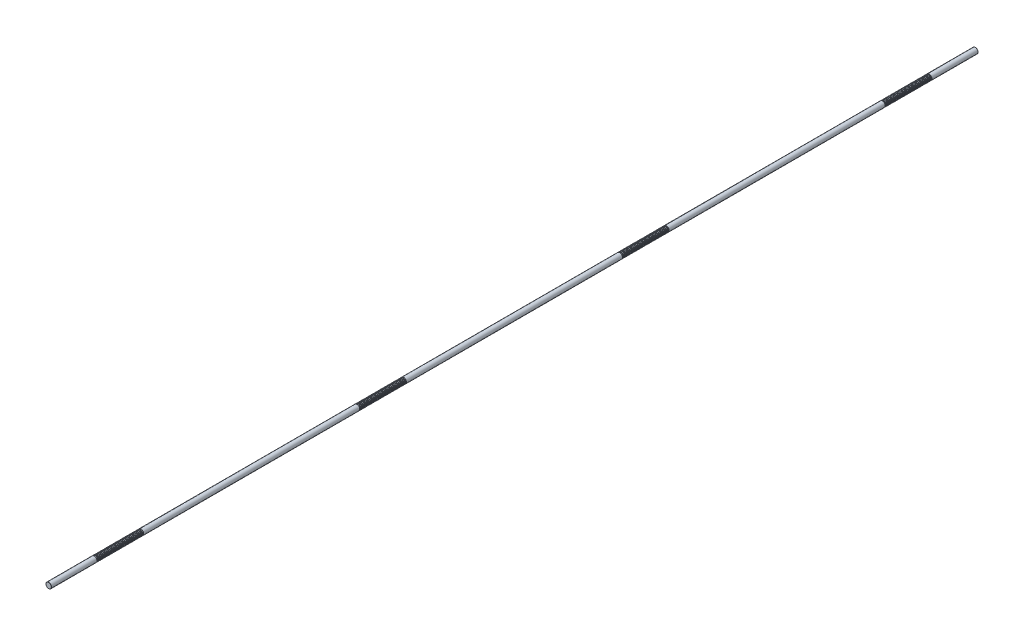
from build123d import *

# Parameters (mm, degrees)
SKETCH1_R           = 6
BOSS_EXTRUDE1_DEPTH = 1000
CHAMFER1_SIZE       = 0.3
LPATTERN1_COUNT     = 34
LPATTERN1_PITCH     = 3
LPATTERN2_COUNT     = 4
LPATTERN2_PITCH     = 567


with BuildPart() as part:
    # Sketch1 → Boss-Extrude1 (new, symmetric)
    with BuildSketch(Plane.XY):
        Circle(SKETCH1_R)
    extrude(amount=BOSS_EXTRUDE1_DEPTH, both=True)

    # Chamfer1
    chamfer1_edges = [part.edges().sort_by_distance(p)[0] for p in [
        (-6, 0, -1000),
        (-6, 0, 1000),
    ]]
    chamfer(chamfer1_edges, length=CHAMFER1_SIZE)

    # Sketch2 → Cut-Revolve1 (revolve, cut)
    with BuildSketch(Plane(origin=(0, 0, 0), x_dir=(0, 0, -1), z_dir=(1, 0, 0)), mode=Mode.PRIVATE) as cut_revolve1_sk:
        Polygon((900.234455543, 6), (898.265544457, 6), (898.734455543, 4.25), (899.765544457, 4.25), align=None)
    cut_revolve1 = revolve(cut_revolve1_sk.sketch.rotate(Axis((0, 0, 1000), (0, 0, -1)), 90), axis=Axis((0, 0, 1000), (0, 0, -1)), mode=Mode.SUBTRACT)

    # LPattern1: Cut-Revolve1 ×34
    with Locations(*[(0, 0, i * LPATTERN1_PITCH) for i in range(1, LPATTERN1_COUNT)]):
        add(cut_revolve1, mode=Mode.SUBTRACT)

    # LPattern2: Cut-Revolve1 ×4
    with Locations(*[(0, 0, i * LPATTERN2_PITCH) for i in range(1, LPATTERN2_COUNT)]):
        add(cut_revolve1, mode=Mode.SUBTRACT)

    # LPattern2 copy 1 sketch → LPattern2 copy 1 (revolve, cut)
    with BuildSketch(Plane(origin=(0, 0, 570), x_dir=(0, 0, -1), z_dir=(1, 0, 0))):
        Polygon((900.234455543, 6), (898.265544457, 6), (898.734455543, 4.25), (899.765544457, 4.25), align=None)
    revolve(axis=Axis((0, 0, 1570), (0, 0, -1)), mode=Mode.SUBTRACT)

    # LPattern2 copy 2 sketch → LPattern2 copy 2 (revolve, cut)
    with BuildSketch(Plane(origin=(0, 0, 1137), x_dir=(0, 0, -1), z_dir=(1, 0, 0))):
        Polygon((900.234455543, 6), (898.265544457, 6), (898.734455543, 4.25), (899.765544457, 4.25), align=None)
    revolve(axis=Axis((0, 0, 2137), (0, 0, -1)), mode=Mode.SUBTRACT)

    # LPattern2 copy 3 sketch → LPattern2 copy 3 (revolve, cut)
    with BuildSketch(Plane(origin=(0, 0, 1704), x_dir=(0, 0, -1), z_dir=(1, 0, 0))):
        Polygon((900.234455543, 6), (898.265544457, 6), (898.734455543, 4.25), (899.765544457, 4.25), align=None)
    revolve(axis=Axis((0, 0, 2704), (0, 0, -1)), mode=Mode.SUBTRACT)

    # LPattern2 copy 4 sketch → LPattern2 copy 4 (revolve, cut)
    with BuildSketch(Plane(origin=(0, 0, 573), x_dir=(0, 0, -1), z_dir=(1, 0, 0))):
        Polygon((900.234455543, 6), (898.265544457, 6), (898.734455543, 4.25), (899.765544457, 4.25), align=None)
    revolve(axis=Axis((0, 0, 1573), (0, 0, -1)), mode=Mode.SUBTRACT)

    # LPattern2 copy 5 sketch → LPattern2 copy 5 (revolve, cut)
    with BuildSketch(Plane(origin=(0, 0, 1140), x_dir=(0, 0, -1), z_dir=(1, 0, 0))):
        Polygon((900.234455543, 6), (898.265544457, 6), (898.734455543, 4.25), (899.765544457, 4.25), align=None)
    revolve(axis=Axis((0, 0, 2140), (0, 0, -1)), mode=Mode.SUBTRACT)

    # LPattern2 copy 6 sketch → LPattern2 copy 6 (revolve, cut)
    with BuildSketch(Plane(origin=(0, 0, 1707), x_dir=(0, 0, -1), z_dir=(1, 0, 0))):
        Polygon((900.234455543, 6), (898.265544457, 6), (898.734455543, 4.25), (899.765544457, 4.25), align=None)
    revolve(axis=Axis((0, 0, 2707), (0, 0, -1)), mode=Mode.SUBTRACT)

    # LPattern2 copy 7 sketch → LPattern2 copy 7 (revolve, cut)
    with BuildSketch(Plane(origin=(0, 0, 576), x_dir=(0, 0, -1), z_dir=(1, 0, 0))):
        Polygon((900.234455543, 6), (898.265544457, 6), (898.734455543, 4.25), (899.765544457, 4.25), align=None)
    revolve(axis=Axis((0, 0, 1576), (0, 0, -1)), mode=Mode.SUBTRACT)

    # LPattern2 copy 8 sketch → LPattern2 copy 8 (revolve, cut)
    with BuildSketch(Plane(origin=(0, 0, 1143), x_dir=(0, 0, -1), z_dir=(1, 0, 0))):
        Polygon((900.234455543, 6), (898.265544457, 6), (898.734455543, 4.25), (899.765544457, 4.25), align=None)
    revolve(axis=Axis((0, 0, 2143), (0, 0, -1)), mode=Mode.SUBTRACT)

    # LPattern2 copy 9 sketch → LPattern2 copy 9 (revolve, cut)
    with BuildSketch(Plane(origin=(0, 0, 1710), x_dir=(0, 0, -1), z_dir=(1, 0, 0))):
        Polygon((900.234455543, 6), (898.265544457, 6), (898.734455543, 4.25), (899.765544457, 4.25), align=None)
    revolve(axis=Axis((0, 0, 2710), (0, 0, -1)), mode=Mode.SUBTRACT)

    # LPattern2 copy 10 sketch → LPattern2 copy 10 (revolve, cut)
    with BuildSketch(Plane(origin=(0, 0, 579), x_dir=(0, 0, -1), z_dir=(1, 0, 0))):
        Polygon((900.234455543, 6), (898.265544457, 6), (898.734455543, 4.25), (899.765544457, 4.25), align=None)
    revolve(axis=Axis((0, 0, 1579), (0, 0, -1)), mode=Mode.SUBTRACT)

    # LPattern2 copy 11 sketch → LPattern2 copy 11 (revolve, cut)
    with BuildSketch(Plane(origin=(0, 0, 1146), x_dir=(0, 0, -1), z_dir=(1, 0, 0))):
        Polygon((900.234455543, 6), (898.265544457, 6), (898.734455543, 4.25), (899.765544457, 4.25), align=None)
    revolve(axis=Axis((0, 0, 2146), (0, 0, -1)), mode=Mode.SUBTRACT)

    # LPattern2 copy 12 sketch → LPattern2 copy 12 (revolve, cut)
    with BuildSketch(Plane(origin=(0, 0, 1713), x_dir=(0, 0, -1), z_dir=(1, 0, 0))):
        Polygon((900.234455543, 6), (898.265544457, 6), (898.734455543, 4.25), (899.765544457, 4.25), align=None)
    revolve(axis=Axis((0, 0, 2713), (0, 0, -1)), mode=Mode.SUBTRACT)

    # LPattern2 copy 13 sketch → LPattern2 copy 13 (revolve, cut)
    with BuildSketch(Plane(origin=(0, 0, 582), x_dir=(0, 0, -1), z_dir=(1, 0, 0))):
        Polygon((900.234455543, 6), (898.265544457, 6), (898.734455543, 4.25), (899.765544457, 4.25), align=None)
    revolve(axis=Axis((0, 0, 1582), (0, 0, -1)), mode=Mode.SUBTRACT)

    # LPattern2 copy 14 sketch → LPattern2 copy 14 (revolve, cut)
    with BuildSketch(Plane(origin=(0, 0, 1149), x_dir=(0, 0, -1), z_dir=(1, 0, 0))):
        Polygon((900.234455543, 6), (898.265544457, 6), (898.734455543, 4.25), (899.765544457, 4.25), align=None)
    revolve(axis=Axis((0, 0, 2149), (0, 0, -1)), mode=Mode.SUBTRACT)

    # LPattern2 copy 15 sketch → LPattern2 copy 15 (revolve, cut)
    with BuildSketch(Plane(origin=(0, 0, 1716), x_dir=(0, 0, -1), z_dir=(1, 0, 0))):
        Polygon((900.234455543, 6), (898.265544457, 6), (898.734455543, 4.25), (899.765544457, 4.25), align=None)
    revolve(axis=Axis((0, 0, 2716), (0, 0, -1)), mode=Mode.SUBTRACT)

    # LPattern2 copy 16 sketch → LPattern2 copy 16 (revolve, cut)
    with BuildSketch(Plane(origin=(0, 0, 585), x_dir=(0, 0, -1), z_dir=(1, 0, 0))):
        Polygon((900.234455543, 6), (898.265544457, 6), (898.734455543, 4.25), (899.765544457, 4.25), align=None)
    revolve(axis=Axis((0, 0, 1585), (0, 0, -1)), mode=Mode.SUBTRACT)

    # LPattern2 copy 17 sketch → LPattern2 copy 17 (revolve, cut)
    with BuildSketch(Plane(origin=(0, 0, 1152), x_dir=(0, 0, -1), z_dir=(1, 0, 0))):
        Polygon((900.234455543, 6), (898.265544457, 6), (898.734455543, 4.25), (899.765544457, 4.25), align=None)
    revolve(axis=Axis((0, 0, 2152), (0, 0, -1)), mode=Mode.SUBTRACT)

    # LPattern2 copy 18 sketch → LPattern2 copy 18 (revolve, cut)
    with BuildSketch(Plane(origin=(0, 0, 1719), x_dir=(0, 0, -1), z_dir=(1, 0, 0))):
        Polygon((900.234455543, 6), (898.265544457, 6), (898.734455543, 4.25), (899.765544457, 4.25), align=None)
    revolve(axis=Axis((0, 0, 2719), (0, 0, -1)), mode=Mode.SUBTRACT)

    # LPattern2 copy 19 sketch → LPattern2 copy 19 (revolve, cut)
    with BuildSketch(Plane(origin=(0, 0, 588), x_dir=(0, 0, -1), z_dir=(1, 0, 0))):
        Polygon((900.234455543, 6), (898.265544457, 6), (898.734455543, 4.25), (899.765544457, 4.25), align=None)
    revolve(axis=Axis((0, 0, 1588), (0, 0, -1)), mode=Mode.SUBTRACT)

    # LPattern2 copy 20 sketch → LPattern2 copy 20 (revolve, cut)
    with BuildSketch(Plane(origin=(0, 0, 1155), x_dir=(0, 0, -1), z_dir=(1, 0, 0))):
        Polygon((900.234455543, 6), (898.265544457, 6), (898.734455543, 4.25), (899.765544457, 4.25), align=None)
    revolve(axis=Axis((0, 0, 2155), (0, 0, -1)), mode=Mode.SUBTRACT)

    # LPattern2 copy 21 sketch → LPattern2 copy 21 (revolve, cut)
    with BuildSketch(Plane(origin=(0, 0, 1722), x_dir=(0, 0, -1), z_dir=(1, 0, 0))):
        Polygon((900.234455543, 6), (898.265544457, 6), (898.734455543, 4.25), (899.765544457, 4.25), align=None)
    revolve(axis=Axis((0, 0, 2722), (0, 0, -1)), mode=Mode.SUBTRACT)

    # LPattern2 copy 22 sketch → LPattern2 copy 22 (revolve, cut)
    with BuildSketch(Plane(origin=(0, 0, 591), x_dir=(0, 0, -1), z_dir=(1, 0, 0))):
        Polygon((900.234455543, 6), (898.265544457, 6), (898.734455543, 4.25), (899.765544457, 4.25), align=None)
    revolve(axis=Axis((0, 0, 1591), (0, 0, -1)), mode=Mode.SUBTRACT)

    # LPattern2 copy 23 sketch → LPattern2 copy 23 (revolve, cut)
    with BuildSketch(Plane(origin=(0, 0, 1158), x_dir=(0, 0, -1), z_dir=(1, 0, 0))):
        Polygon((900.234455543, 6), (898.265544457, 6), (898.734455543, 4.25), (899.765544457, 4.25), align=None)
    revolve(axis=Axis((0, 0, 2158), (0, 0, -1)), mode=Mode.SUBTRACT)

    # LPattern2 copy 24 sketch → LPattern2 copy 24 (revolve, cut)
    with BuildSketch(Plane(origin=(0, 0, 1725), x_dir=(0, 0, -1), z_dir=(1, 0, 0))):
        Polygon((900.234455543, 6), (898.265544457, 6), (898.734455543, 4.25), (899.765544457, 4.25), align=None)
    revolve(axis=Axis((0, 0, 2725), (0, 0, -1)), mode=Mode.SUBTRACT)

    # LPattern2 copy 25 sketch → LPattern2 copy 25 (revolve, cut)
    with BuildSketch(Plane(origin=(0, 0, 594), x_dir=(0, 0, -1), z_dir=(1, 0, 0))):
        Polygon((900.234455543, 6), (898.265544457, 6), (898.734455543, 4.25), (899.765544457, 4.25), align=None)
    revolve(axis=Axis((0, 0, 1594), (0, 0, -1)), mode=Mode.SUBTRACT)

    # LPattern2 copy 26 sketch → LPattern2 copy 26 (revolve, cut)
    with BuildSketch(Plane(origin=(0, 0, 1161), x_dir=(0, 0, -1), z_dir=(1, 0, 0))):
        Polygon((900.234455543, 6), (898.265544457, 6), (898.734455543, 4.25), (899.765544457, 4.25), align=None)
    revolve(axis=Axis((0, 0, 2161), (0, 0, -1)), mode=Mode.SUBTRACT)

    # LPattern2 copy 27 sketch → LPattern2 copy 27 (revolve, cut)
    with BuildSketch(Plane(origin=(0, 0, 1728), x_dir=(0, 0, -1), z_dir=(1, 0, 0))):
        Polygon((900.234455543, 6), (898.265544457, 6), (898.734455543, 4.25), (899.765544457, 4.25), align=None)
    revolve(axis=Axis((0, 0, 2728), (0, 0, -1)), mode=Mode.SUBTRACT)

    # LPattern2 copy 28 sketch → LPattern2 copy 28 (revolve, cut)
    with BuildSketch(Plane(origin=(0, 0, 597), x_dir=(0, 0, -1), z_dir=(1, 0, 0))):
        Polygon((900.234455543, 6), (898.265544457, 6), (898.734455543, 4.25), (899.765544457, 4.25), align=None)
    revolve(axis=Axis((0, 0, 1597), (0, 0, -1)), mode=Mode.SUBTRACT)

    # LPattern2 copy 29 sketch → LPattern2 copy 29 (revolve, cut)
    with BuildSketch(Plane(origin=(0, 0, 1164), x_dir=(0, 0, -1), z_dir=(1, 0, 0))):
        Polygon((900.234455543, 6), (898.265544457, 6), (898.734455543, 4.25), (899.765544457, 4.25), align=None)
    revolve(axis=Axis((0, 0, 2164), (0, 0, -1)), mode=Mode.SUBTRACT)

    # LPattern2 copy 30 sketch → LPattern2 copy 30 (revolve, cut)
    with BuildSketch(Plane(origin=(0, 0, 1731), x_dir=(0, 0, -1), z_dir=(1, 0, 0))):
        Polygon((900.234455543, 6), (898.265544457, 6), (898.734455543, 4.25), (899.765544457, 4.25), align=None)
    revolve(axis=Axis((0, 0, 2731), (0, 0, -1)), mode=Mode.SUBTRACT)

    # LPattern2 copy 31 sketch → LPattern2 copy 31 (revolve, cut)
    with BuildSketch(Plane(origin=(0, 0, 600), x_dir=(0, 0, -1), z_dir=(1, 0, 0))):
        Polygon((900.234455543, 6), (898.265544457, 6), (898.734455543, 4.25), (899.765544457, 4.25), align=None)
    revolve(axis=Axis((0, 0, 1600), (0, 0, -1)), mode=Mode.SUBTRACT)

    # LPattern2 copy 32 sketch → LPattern2 copy 32 (revolve, cut)
    with BuildSketch(Plane(origin=(0, 0, 1167), x_dir=(0, 0, -1), z_dir=(1, 0, 0))):
        Polygon((900.234455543, 6), (898.265544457, 6), (898.734455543, 4.25), (899.765544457, 4.25), align=None)
    revolve(axis=Axis((0, 0, 2167), (0, 0, -1)), mode=Mode.SUBTRACT)

    # LPattern2 copy 33 sketch → LPattern2 copy 33 (revolve, cut)
    with BuildSketch(Plane(origin=(0, 0, 1734), x_dir=(0, 0, -1), z_dir=(1, 0, 0))):
        Polygon((900.234455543, 6), (898.265544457, 6), (898.734455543, 4.25), (899.765544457, 4.25), align=None)
    revolve(axis=Axis((0, 0, 2734), (0, 0, -1)), mode=Mode.SUBTRACT)

    # LPattern2 copy 34 sketch → LPattern2 copy 34 (revolve, cut)
    with BuildSketch(Plane(origin=(0, 0, 603), x_dir=(0, 0, -1), z_dir=(1, 0, 0))):
        Polygon((900.234455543, 6), (898.265544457, 6), (898.734455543, 4.25), (899.765544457, 4.25), align=None)
    revolve(axis=Axis((0, 0, 1603), (0, 0, -1)), mode=Mode.SUBTRACT)

    # LPattern2 copy 35 sketch → LPattern2 copy 35 (revolve, cut)
    with BuildSketch(Plane(origin=(0, 0, 1170), x_dir=(0, 0, -1), z_dir=(1, 0, 0))):
        Polygon((900.234455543, 6), (898.265544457, 6), (898.734455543, 4.25), (899.765544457, 4.25), align=None)
    revolve(axis=Axis((0, 0, 2170), (0, 0, -1)), mode=Mode.SUBTRACT)

    # LPattern2 copy 36 sketch → LPattern2 copy 36 (revolve, cut)
    with BuildSketch(Plane(origin=(0, 0, 1737), x_dir=(0, 0, -1), z_dir=(1, 0, 0))):
        Polygon((900.234455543, 6), (898.265544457, 6), (898.734455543, 4.25), (899.765544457, 4.25), align=None)
    revolve(axis=Axis((0, 0, 2737), (0, 0, -1)), mode=Mode.SUBTRACT)

    # LPattern2 copy 37 sketch → LPattern2 copy 37 (revolve, cut)
    with BuildSketch(Plane(origin=(0, 0, 606), x_dir=(0, 0, -1), z_dir=(1, 0, 0))):
        Polygon((900.234455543, 6), (898.265544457, 6), (898.734455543, 4.25), (899.765544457, 4.25), align=None)
    revolve(axis=Axis((0, 0, 1606), (0, 0, -1)), mode=Mode.SUBTRACT)

    # LPattern2 copy 38 sketch → LPattern2 copy 38 (revolve, cut)
    with BuildSketch(Plane(origin=(0, 0, 1173), x_dir=(0, 0, -1), z_dir=(1, 0, 0))):
        Polygon((900.234455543, 6), (898.265544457, 6), (898.734455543, 4.25), (899.765544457, 4.25), align=None)
    revolve(axis=Axis((0, 0, 2173), (0, 0, -1)), mode=Mode.SUBTRACT)

    # LPattern2 copy 39 sketch → LPattern2 copy 39 (revolve, cut)
    with BuildSketch(Plane(origin=(0, 0, 1740), x_dir=(0, 0, -1), z_dir=(1, 0, 0))):
        Polygon((900.234455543, 6), (898.265544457, 6), (898.734455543, 4.25), (899.765544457, 4.25), align=None)
    revolve(axis=Axis((0, 0, 2740), (0, 0, -1)), mode=Mode.SUBTRACT)

    # LPattern2 copy 40 sketch → LPattern2 copy 40 (revolve, cut)
    with BuildSketch(Plane(origin=(0, 0, 609), x_dir=(0, 0, -1), z_dir=(1, 0, 0))):
        Polygon((900.234455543, 6), (898.265544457, 6), (898.734455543, 4.25), (899.765544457, 4.25), align=None)
    revolve(axis=Axis((0, 0, 1609), (0, 0, -1)), mode=Mode.SUBTRACT)

    # LPattern2 copy 41 sketch → LPattern2 copy 41 (revolve, cut)
    with BuildSketch(Plane(origin=(0, 0, 1176), x_dir=(0, 0, -1), z_dir=(1, 0, 0))):
        Polygon((900.234455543, 6), (898.265544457, 6), (898.734455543, 4.25), (899.765544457, 4.25), align=None)
    revolve(axis=Axis((0, 0, 2176), (0, 0, -1)), mode=Mode.SUBTRACT)

    # LPattern2 copy 42 sketch → LPattern2 copy 42 (revolve, cut)
    with BuildSketch(Plane(origin=(0, 0, 1743), x_dir=(0, 0, -1), z_dir=(1, 0, 0))):
        Polygon((900.234455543, 6), (898.265544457, 6), (898.734455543, 4.25), (899.765544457, 4.25), align=None)
    revolve(axis=Axis((0, 0, 2743), (0, 0, -1)), mode=Mode.SUBTRACT)

    # LPattern2 copy 43 sketch → LPattern2 copy 43 (revolve, cut)
    with BuildSketch(Plane(origin=(0, 0, 612), x_dir=(0, 0, -1), z_dir=(1, 0, 0))):
        Polygon((900.234455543, 6), (898.265544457, 6), (898.734455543, 4.25), (899.765544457, 4.25), align=None)
    revolve(axis=Axis((0, 0, 1612), (0, 0, -1)), mode=Mode.SUBTRACT)

    # LPattern2 copy 44 sketch → LPattern2 copy 44 (revolve, cut)
    with BuildSketch(Plane(origin=(0, 0, 1179), x_dir=(0, 0, -1), z_dir=(1, 0, 0))):
        Polygon((900.234455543, 6), (898.265544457, 6), (898.734455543, 4.25), (899.765544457, 4.25), align=None)
    revolve(axis=Axis((0, 0, 2179), (0, 0, -1)), mode=Mode.SUBTRACT)

    # LPattern2 copy 45 sketch → LPattern2 copy 45 (revolve, cut)
    with BuildSketch(Plane(origin=(0, 0, 1746), x_dir=(0, 0, -1), z_dir=(1, 0, 0))):
        Polygon((900.234455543, 6), (898.265544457, 6), (898.734455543, 4.25), (899.765544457, 4.25), align=None)
    revolve(axis=Axis((0, 0, 2746), (0, 0, -1)), mode=Mode.SUBTRACT)

    # LPattern2 copy 46 sketch → LPattern2 copy 46 (revolve, cut)
    with BuildSketch(Plane(origin=(0, 0, 615), x_dir=(0, 0, -1), z_dir=(1, 0, 0))):
        Polygon((900.234455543, 6), (898.265544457, 6), (898.734455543, 4.25), (899.765544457, 4.25), align=None)
    revolve(axis=Axis((0, 0, 1615), (0, 0, -1)), mode=Mode.SUBTRACT)

    # LPattern2 copy 47 sketch → LPattern2 copy 47 (revolve, cut)
    with BuildSketch(Plane(origin=(0, 0, 1182), x_dir=(0, 0, -1), z_dir=(1, 0, 0))):
        Polygon((900.234455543, 6), (898.265544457, 6), (898.734455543, 4.25), (899.765544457, 4.25), align=None)
    revolve(axis=Axis((0, 0, 2182), (0, 0, -1)), mode=Mode.SUBTRACT)

    # LPattern2 copy 48 sketch → LPattern2 copy 48 (revolve, cut)
    with BuildSketch(Plane(origin=(0, 0, 1749), x_dir=(0, 0, -1), z_dir=(1, 0, 0))):
        Polygon((900.234455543, 6), (898.265544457, 6), (898.734455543, 4.25), (899.765544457, 4.25), align=None)
    revolve(axis=Axis((0, 0, 2749), (0, 0, -1)), mode=Mode.SUBTRACT)

    # LPattern2 copy 49 sketch → LPattern2 copy 49 (revolve, cut)
    with BuildSketch(Plane(origin=(0, 0, 618), x_dir=(0, 0, -1), z_dir=(1, 0, 0))):
        Polygon((900.234455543, 6), (898.265544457, 6), (898.734455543, 4.25), (899.765544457, 4.25), align=None)
    revolve(axis=Axis((0, 0, 1618), (0, 0, -1)), mode=Mode.SUBTRACT)

    # LPattern2 copy 50 sketch → LPattern2 copy 50 (revolve, cut)
    with BuildSketch(Plane(origin=(0, 0, 1185), x_dir=(0, 0, -1), z_dir=(1, 0, 0))):
        Polygon((900.234455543, 6), (898.265544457, 6), (898.734455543, 4.25), (899.765544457, 4.25), align=None)
    revolve(axis=Axis((0, 0, 2185), (0, 0, -1)), mode=Mode.SUBTRACT)

    # LPattern2 copy 51 sketch → LPattern2 copy 51 (revolve, cut)
    with BuildSketch(Plane(origin=(0, 0, 1752), x_dir=(0, 0, -1), z_dir=(1, 0, 0))):
        Polygon((900.234455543, 6), (898.265544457, 6), (898.734455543, 4.25), (899.765544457, 4.25), align=None)
    revolve(axis=Axis((0, 0, 2752), (0, 0, -1)), mode=Mode.SUBTRACT)

    # LPattern2 copy 52 sketch → LPattern2 copy 52 (revolve, cut)
    with BuildSketch(Plane(origin=(0, 0, 621), x_dir=(0, 0, -1), z_dir=(1, 0, 0))):
        Polygon((900.234455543, 6), (898.265544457, 6), (898.734455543, 4.25), (899.765544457, 4.25), align=None)
    revolve(axis=Axis((0, 0, 1621), (0, 0, -1)), mode=Mode.SUBTRACT)

    # LPattern2 copy 53 sketch → LPattern2 copy 53 (revolve, cut)
    with BuildSketch(Plane(origin=(0, 0, 1188), x_dir=(0, 0, -1), z_dir=(1, 0, 0))):
        Polygon((900.234455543, 6), (898.265544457, 6), (898.734455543, 4.25), (899.765544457, 4.25), align=None)
    revolve(axis=Axis((0, 0, 2188), (0, 0, -1)), mode=Mode.SUBTRACT)

    # LPattern2 copy 54 sketch → LPattern2 copy 54 (revolve, cut)
    with BuildSketch(Plane(origin=(0, 0, 1755), x_dir=(0, 0, -1), z_dir=(1, 0, 0))):
        Polygon((900.234455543, 6), (898.265544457, 6), (898.734455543, 4.25), (899.765544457, 4.25), align=None)
    revolve(axis=Axis((0, 0, 2755), (0, 0, -1)), mode=Mode.SUBTRACT)

    # LPattern2 copy 55 sketch → LPattern2 copy 55 (revolve, cut)
    with BuildSketch(Plane(origin=(0, 0, 624), x_dir=(0, 0, -1), z_dir=(1, 0, 0))):
        Polygon((900.234455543, 6), (898.265544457, 6), (898.734455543, 4.25), (899.765544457, 4.25), align=None)
    revolve(axis=Axis((0, 0, 1624), (0, 0, -1)), mode=Mode.SUBTRACT)

    # LPattern2 copy 56 sketch → LPattern2 copy 56 (revolve, cut)
    with BuildSketch(Plane(origin=(0, 0, 1191), x_dir=(0, 0, -1), z_dir=(1, 0, 0))):
        Polygon((900.234455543, 6), (898.265544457, 6), (898.734455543, 4.25), (899.765544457, 4.25), align=None)
    revolve(axis=Axis((0, 0, 2191), (0, 0, -1)), mode=Mode.SUBTRACT)

    # LPattern2 copy 57 sketch → LPattern2 copy 57 (revolve, cut)
    with BuildSketch(Plane(origin=(0, 0, 1758), x_dir=(0, 0, -1), z_dir=(1, 0, 0))):
        Polygon((900.234455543, 6), (898.265544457, 6), (898.734455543, 4.25), (899.765544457, 4.25), align=None)
    revolve(axis=Axis((0, 0, 2758), (0, 0, -1)), mode=Mode.SUBTRACT)

    # LPattern2 copy 58 sketch → LPattern2 copy 58 (revolve, cut)
    with BuildSketch(Plane(origin=(0, 0, 627), x_dir=(0, 0, -1), z_dir=(1, 0, 0))):
        Polygon((900.234455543, 6), (898.265544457, 6), (898.734455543, 4.25), (899.765544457, 4.25), align=None)
    revolve(axis=Axis((0, 0, 1627), (0, 0, -1)), mode=Mode.SUBTRACT)

    # LPattern2 copy 59 sketch → LPattern2 copy 59 (revolve, cut)
    with BuildSketch(Plane(origin=(0, 0, 1194), x_dir=(0, 0, -1), z_dir=(1, 0, 0))):
        Polygon((900.234455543, 6), (898.265544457, 6), (898.734455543, 4.25), (899.765544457, 4.25), align=None)
    revolve(axis=Axis((0, 0, 2194), (0, 0, -1)), mode=Mode.SUBTRACT)

    # LPattern2 copy 60 sketch → LPattern2 copy 60 (revolve, cut)
    with BuildSketch(Plane(origin=(0, 0, 1761), x_dir=(0, 0, -1), z_dir=(1, 0, 0))):
        Polygon((900.234455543, 6), (898.265544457, 6), (898.734455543, 4.25), (899.765544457, 4.25), align=None)
    revolve(axis=Axis((0, 0, 2761), (0, 0, -1)), mode=Mode.SUBTRACT)

    # LPattern2 copy 61 sketch → LPattern2 copy 61 (revolve, cut)
    with BuildSketch(Plane(origin=(0, 0, 630), x_dir=(0, 0, -1), z_dir=(1, 0, 0))):
        Polygon((900.234455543, 6), (898.265544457, 6), (898.734455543, 4.25), (899.765544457, 4.25), align=None)
    revolve(axis=Axis((0, 0, 1630), (0, 0, -1)), mode=Mode.SUBTRACT)

    # LPattern2 copy 62 sketch → LPattern2 copy 62 (revolve, cut)
    with BuildSketch(Plane(origin=(0, 0, 1197), x_dir=(0, 0, -1), z_dir=(1, 0, 0))):
        Polygon((900.234455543, 6), (898.265544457, 6), (898.734455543, 4.25), (899.765544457, 4.25), align=None)
    revolve(axis=Axis((0, 0, 2197), (0, 0, -1)), mode=Mode.SUBTRACT)

    # LPattern2 copy 63 sketch → LPattern2 copy 63 (revolve, cut)
    with BuildSketch(Plane(origin=(0, 0, 1764), x_dir=(0, 0, -1), z_dir=(1, 0, 0))):
        Polygon((900.234455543, 6), (898.265544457, 6), (898.734455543, 4.25), (899.765544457, 4.25), align=None)
    revolve(axis=Axis((0, 0, 2764), (0, 0, -1)), mode=Mode.SUBTRACT)

    # LPattern2 copy 64 sketch → LPattern2 copy 64 (revolve, cut)
    with BuildSketch(Plane(origin=(0, 0, 633), x_dir=(0, 0, -1), z_dir=(1, 0, 0))):
        Polygon((900.234455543, 6), (898.265544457, 6), (898.734455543, 4.25), (899.765544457, 4.25), align=None)
    revolve(axis=Axis((0, 0, 1633), (0, 0, -1)), mode=Mode.SUBTRACT)

    # LPattern2 copy 65 sketch → LPattern2 copy 65 (revolve, cut)
    with BuildSketch(Plane(origin=(0, 0, 1200), x_dir=(0, 0, -1), z_dir=(1, 0, 0))):
        Polygon((900.234455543, 6), (898.265544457, 6), (898.734455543, 4.25), (899.765544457, 4.25), align=None)
    revolve(axis=Axis((0, 0, 2200), (0, 0, -1)), mode=Mode.SUBTRACT)

    # LPattern2 copy 66 sketch → LPattern2 copy 66 (revolve, cut)
    with BuildSketch(Plane(origin=(0, 0, 1767), x_dir=(0, 0, -1), z_dir=(1, 0, 0))):
        Polygon((900.234455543, 6), (898.265544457, 6), (898.734455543, 4.25), (899.765544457, 4.25), align=None)
    revolve(axis=Axis((0, 0, 2767), (0, 0, -1)), mode=Mode.SUBTRACT)

    # LPattern2 copy 67 sketch → LPattern2 copy 67 (revolve, cut)
    with BuildSketch(Plane(origin=(0, 0, 636), x_dir=(0, 0, -1), z_dir=(1, 0, 0))):
        Polygon((900.234455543, 6), (898.265544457, 6), (898.734455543, 4.25), (899.765544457, 4.25), align=None)
    revolve(axis=Axis((0, 0, 1636), (0, 0, -1)), mode=Mode.SUBTRACT)

    # LPattern2 copy 68 sketch → LPattern2 copy 68 (revolve, cut)
    with BuildSketch(Plane(origin=(0, 0, 1203), x_dir=(0, 0, -1), z_dir=(1, 0, 0))):
        Polygon((900.234455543, 6), (898.265544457, 6), (898.734455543, 4.25), (899.765544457, 4.25), align=None)
    revolve(axis=Axis((0, 0, 2203), (0, 0, -1)), mode=Mode.SUBTRACT)

    # LPattern2 copy 69 sketch → LPattern2 copy 69 (revolve, cut)
    with BuildSketch(Plane(origin=(0, 0, 1770), x_dir=(0, 0, -1), z_dir=(1, 0, 0))):
        Polygon((900.234455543, 6), (898.265544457, 6), (898.734455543, 4.25), (899.765544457, 4.25), align=None)
    revolve(axis=Axis((0, 0, 2770), (0, 0, -1)), mode=Mode.SUBTRACT)

    # LPattern2 copy 70 sketch → LPattern2 copy 70 (revolve, cut)
    with BuildSketch(Plane(origin=(0, 0, 639), x_dir=(0, 0, -1), z_dir=(1, 0, 0))):
        Polygon((900.234455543, 6), (898.265544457, 6), (898.734455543, 4.25), (899.765544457, 4.25), align=None)
    revolve(axis=Axis((0, 0, 1639), (0, 0, -1)), mode=Mode.SUBTRACT)

    # LPattern2 copy 71 sketch → LPattern2 copy 71 (revolve, cut)
    with BuildSketch(Plane(origin=(0, 0, 1206), x_dir=(0, 0, -1), z_dir=(1, 0, 0))):
        Polygon((900.234455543, 6), (898.265544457, 6), (898.734455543, 4.25), (899.765544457, 4.25), align=None)
    revolve(axis=Axis((0, 0, 2206), (0, 0, -1)), mode=Mode.SUBTRACT)

    # LPattern2 copy 72 sketch → LPattern2 copy 72 (revolve, cut)
    with BuildSketch(Plane(origin=(0, 0, 1773), x_dir=(0, 0, -1), z_dir=(1, 0, 0))):
        Polygon((900.234455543, 6), (898.265544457, 6), (898.734455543, 4.25), (899.765544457, 4.25), align=None)
    revolve(axis=Axis((0, 0, 2773), (0, 0, -1)), mode=Mode.SUBTRACT)

    # LPattern2 copy 73 sketch → LPattern2 copy 73 (revolve, cut)
    with BuildSketch(Plane(origin=(0, 0, 642), x_dir=(0, 0, -1), z_dir=(1, 0, 0))):
        Polygon((900.234455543, 6), (898.265544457, 6), (898.734455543, 4.25), (899.765544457, 4.25), align=None)
    revolve(axis=Axis((0, 0, 1642), (0, 0, -1)), mode=Mode.SUBTRACT)

    # LPattern2 copy 74 sketch → LPattern2 copy 74 (revolve, cut)
    with BuildSketch(Plane(origin=(0, 0, 1209), x_dir=(0, 0, -1), z_dir=(1, 0, 0))):
        Polygon((900.234455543, 6), (898.265544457, 6), (898.734455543, 4.25), (899.765544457, 4.25), align=None)
    revolve(axis=Axis((0, 0, 2209), (0, 0, -1)), mode=Mode.SUBTRACT)

    # LPattern2 copy 75 sketch → LPattern2 copy 75 (revolve, cut)
    with BuildSketch(Plane(origin=(0, 0, 1776), x_dir=(0, 0, -1), z_dir=(1, 0, 0))):
        Polygon((900.234455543, 6), (898.265544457, 6), (898.734455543, 4.25), (899.765544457, 4.25), align=None)
    revolve(axis=Axis((0, 0, 2776), (0, 0, -1)), mode=Mode.SUBTRACT)

    # LPattern2 copy 76 sketch → LPattern2 copy 76 (revolve, cut)
    with BuildSketch(Plane(origin=(0, 0, 645), x_dir=(0, 0, -1), z_dir=(1, 0, 0))):
        Polygon((900.234455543, 6), (898.265544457, 6), (898.734455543, 4.25), (899.765544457, 4.25), align=None)
    revolve(axis=Axis((0, 0, 1645), (0, 0, -1)), mode=Mode.SUBTRACT)

    # LPattern2 copy 77 sketch → LPattern2 copy 77 (revolve, cut)
    with BuildSketch(Plane(origin=(0, 0, 1212), x_dir=(0, 0, -1), z_dir=(1, 0, 0))):
        Polygon((900.234455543, 6), (898.265544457, 6), (898.734455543, 4.25), (899.765544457, 4.25), align=None)
    revolve(axis=Axis((0, 0, 2212), (0, 0, -1)), mode=Mode.SUBTRACT)

    # LPattern2 copy 78 sketch → LPattern2 copy 78 (revolve, cut)
    with BuildSketch(Plane(origin=(0, 0, 1779), x_dir=(0, 0, -1), z_dir=(1, 0, 0))):
        Polygon((900.234455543, 6), (898.265544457, 6), (898.734455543, 4.25), (899.765544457, 4.25), align=None)
    revolve(axis=Axis((0, 0, 2779), (0, 0, -1)), mode=Mode.SUBTRACT)

    # LPattern2 copy 79 sketch → LPattern2 copy 79 (revolve, cut)
    with BuildSketch(Plane(origin=(0, 0, 648), x_dir=(0, 0, -1), z_dir=(1, 0, 0))):
        Polygon((900.234455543, 6), (898.265544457, 6), (898.734455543, 4.25), (899.765544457, 4.25), align=None)
    revolve(axis=Axis((0, 0, 1648), (0, 0, -1)), mode=Mode.SUBTRACT)

    # LPattern2 copy 80 sketch → LPattern2 copy 80 (revolve, cut)
    with BuildSketch(Plane(origin=(0, 0, 1215), x_dir=(0, 0, -1), z_dir=(1, 0, 0))):
        Polygon((900.234455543, 6), (898.265544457, 6), (898.734455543, 4.25), (899.765544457, 4.25), align=None)
    revolve(axis=Axis((0, 0, 2215), (0, 0, -1)), mode=Mode.SUBTRACT)

    # LPattern2 copy 81 sketch → LPattern2 copy 81 (revolve, cut)
    with BuildSketch(Plane(origin=(0, 0, 1782), x_dir=(0, 0, -1), z_dir=(1, 0, 0))):
        Polygon((900.234455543, 6), (898.265544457, 6), (898.734455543, 4.25), (899.765544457, 4.25), align=None)
    revolve(axis=Axis((0, 0, 2782), (0, 0, -1)), mode=Mode.SUBTRACT)

    # LPattern2 copy 82 sketch → LPattern2 copy 82 (revolve, cut)
    with BuildSketch(Plane(origin=(0, 0, 651), x_dir=(0, 0, -1), z_dir=(1, 0, 0))):
        Polygon((900.234455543, 6), (898.265544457, 6), (898.734455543, 4.25), (899.765544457, 4.25), align=None)
    revolve(axis=Axis((0, 0, 1651), (0, 0, -1)), mode=Mode.SUBTRACT)

    # LPattern2 copy 83 sketch → LPattern2 copy 83 (revolve, cut)
    with BuildSketch(Plane(origin=(0, 0, 1218), x_dir=(0, 0, -1), z_dir=(1, 0, 0))):
        Polygon((900.234455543, 6), (898.265544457, 6), (898.734455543, 4.25), (899.765544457, 4.25), align=None)
    revolve(axis=Axis((0, 0, 2218), (0, 0, -1)), mode=Mode.SUBTRACT)

    # LPattern2 copy 84 sketch → LPattern2 copy 84 (revolve, cut)
    with BuildSketch(Plane(origin=(0, 0, 1785), x_dir=(0, 0, -1), z_dir=(1, 0, 0))):
        Polygon((900.234455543, 6), (898.265544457, 6), (898.734455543, 4.25), (899.765544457, 4.25), align=None)
    revolve(axis=Axis((0, 0, 2785), (0, 0, -1)), mode=Mode.SUBTRACT)

    # LPattern2 copy 85 sketch → LPattern2 copy 85 (revolve, cut)
    with BuildSketch(Plane(origin=(0, 0, 654), x_dir=(0, 0, -1), z_dir=(1, 0, 0))):
        Polygon((900.234455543, 6), (898.265544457, 6), (898.734455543, 4.25), (899.765544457, 4.25), align=None)
    revolve(axis=Axis((0, 0, 1654), (0, 0, -1)), mode=Mode.SUBTRACT)

    # LPattern2 copy 86 sketch → LPattern2 copy 86 (revolve, cut)
    with BuildSketch(Plane(origin=(0, 0, 1221), x_dir=(0, 0, -1), z_dir=(1, 0, 0))):
        Polygon((900.234455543, 6), (898.265544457, 6), (898.734455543, 4.25), (899.765544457, 4.25), align=None)
    revolve(axis=Axis((0, 0, 2221), (0, 0, -1)), mode=Mode.SUBTRACT)

    # LPattern2 copy 87 sketch → LPattern2 copy 87 (revolve, cut)
    with BuildSketch(Plane(origin=(0, 0, 1788), x_dir=(0, 0, -1), z_dir=(1, 0, 0))):
        Polygon((900.234455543, 6), (898.265544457, 6), (898.734455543, 4.25), (899.765544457, 4.25), align=None)
    revolve(axis=Axis((0, 0, 2788), (0, 0, -1)), mode=Mode.SUBTRACT)

    # LPattern2 copy 88 sketch → LPattern2 copy 88 (revolve, cut)
    with BuildSketch(Plane(origin=(0, 0, 657), x_dir=(0, 0, -1), z_dir=(1, 0, 0))):
        Polygon((900.234455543, 6), (898.265544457, 6), (898.734455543, 4.25), (899.765544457, 4.25), align=None)
    revolve(axis=Axis((0, 0, 1657), (0, 0, -1)), mode=Mode.SUBTRACT)

    # LPattern2 copy 89 sketch → LPattern2 copy 89 (revolve, cut)
    with BuildSketch(Plane(origin=(0, 0, 1224), x_dir=(0, 0, -1), z_dir=(1, 0, 0))):
        Polygon((900.234455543, 6), (898.265544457, 6), (898.734455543, 4.25), (899.765544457, 4.25), align=None)
    revolve(axis=Axis((0, 0, 2224), (0, 0, -1)), mode=Mode.SUBTRACT)

    # LPattern2 copy 90 sketch → LPattern2 copy 90 (revolve, cut)
    with BuildSketch(Plane(origin=(0, 0, 1791), x_dir=(0, 0, -1), z_dir=(1, 0, 0))):
        Polygon((900.234455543, 6), (898.265544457, 6), (898.734455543, 4.25), (899.765544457, 4.25), align=None)
    revolve(axis=Axis((0, 0, 2791), (0, 0, -1)), mode=Mode.SUBTRACT)

    # LPattern2 copy 91 sketch → LPattern2 copy 91 (revolve, cut)
    with BuildSketch(Plane(origin=(0, 0, 660), x_dir=(0, 0, -1), z_dir=(1, 0, 0))):
        Polygon((900.234455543, 6), (898.265544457, 6), (898.734455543, 4.25), (899.765544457, 4.25), align=None)
    revolve(axis=Axis((0, 0, 1660), (0, 0, -1)), mode=Mode.SUBTRACT)

    # LPattern2 copy 92 sketch → LPattern2 copy 92 (revolve, cut)
    with BuildSketch(Plane(origin=(0, 0, 1227), x_dir=(0, 0, -1), z_dir=(1, 0, 0))):
        Polygon((900.234455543, 6), (898.265544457, 6), (898.734455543, 4.25), (899.765544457, 4.25), align=None)
    revolve(axis=Axis((0, 0, 2227), (0, 0, -1)), mode=Mode.SUBTRACT)

    # LPattern2 copy 93 sketch → LPattern2 copy 93 (revolve, cut)
    with BuildSketch(Plane(origin=(0, 0, 1794), x_dir=(0, 0, -1), z_dir=(1, 0, 0))):
        Polygon((900.234455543, 6), (898.265544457, 6), (898.734455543, 4.25), (899.765544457, 4.25), align=None)
    revolve(axis=Axis((0, 0, 2794), (0, 0, -1)), mode=Mode.SUBTRACT)

    # LPattern2 copy 94 sketch → LPattern2 copy 94 (revolve, cut)
    with BuildSketch(Plane(origin=(0, 0, 663), x_dir=(0, 0, -1), z_dir=(1, 0, 0))):
        Polygon((900.234455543, 6), (898.265544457, 6), (898.734455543, 4.25), (899.765544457, 4.25), align=None)
    revolve(axis=Axis((0, 0, 1663), (0, 0, -1)), mode=Mode.SUBTRACT)

    # LPattern2 copy 95 sketch → LPattern2 copy 95 (revolve, cut)
    with BuildSketch(Plane(origin=(0, 0, 1230), x_dir=(0, 0, -1), z_dir=(1, 0, 0))):
        Polygon((900.234455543, 6), (898.265544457, 6), (898.734455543, 4.25), (899.765544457, 4.25), align=None)
    revolve(axis=Axis((0, 0, 2230), (0, 0, -1)), mode=Mode.SUBTRACT)

    # LPattern2 copy 96 sketch → LPattern2 copy 96 (revolve, cut)
    with BuildSketch(Plane(origin=(0, 0, 1797), x_dir=(0, 0, -1), z_dir=(1, 0, 0))):
        Polygon((900.234455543, 6), (898.265544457, 6), (898.734455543, 4.25), (899.765544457, 4.25), align=None)
    revolve(axis=Axis((0, 0, 2797), (0, 0, -1)), mode=Mode.SUBTRACT)

    # LPattern2 copy 97 sketch → LPattern2 copy 97 (revolve, cut)
    with BuildSketch(Plane(origin=(0, 0, 666), x_dir=(0, 0, -1), z_dir=(1, 0, 0))):
        Polygon((900.234455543, 6), (898.265544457, 6), (898.734455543, 4.25), (899.765544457, 4.25), align=None)
    revolve(axis=Axis((0, 0, 1666), (0, 0, -1)), mode=Mode.SUBTRACT)

    # LPattern2 copy 98 sketch → LPattern2 copy 98 (revolve, cut)
    with BuildSketch(Plane(origin=(0, 0, 1233), x_dir=(0, 0, -1), z_dir=(1, 0, 0))):
        Polygon((900.234455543, 6), (898.265544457, 6), (898.734455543, 4.25), (899.765544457, 4.25), align=None)
    revolve(axis=Axis((0, 0, 2233), (0, 0, -1)), mode=Mode.SUBTRACT)

    # LPattern2 copy 99 sketch → LPattern2 copy 99 (revolve, cut)
    with BuildSketch(Plane(origin=(0, 0, 1800), x_dir=(0, 0, -1), z_dir=(1, 0, 0))):
        Polygon((900.234455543, 6), (898.265544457, 6), (898.734455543, 4.25), (899.765544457, 4.25), align=None)
    revolve(axis=Axis((0, 0, 2800), (0, 0, -1)), mode=Mode.SUBTRACT)


solid = part.part
